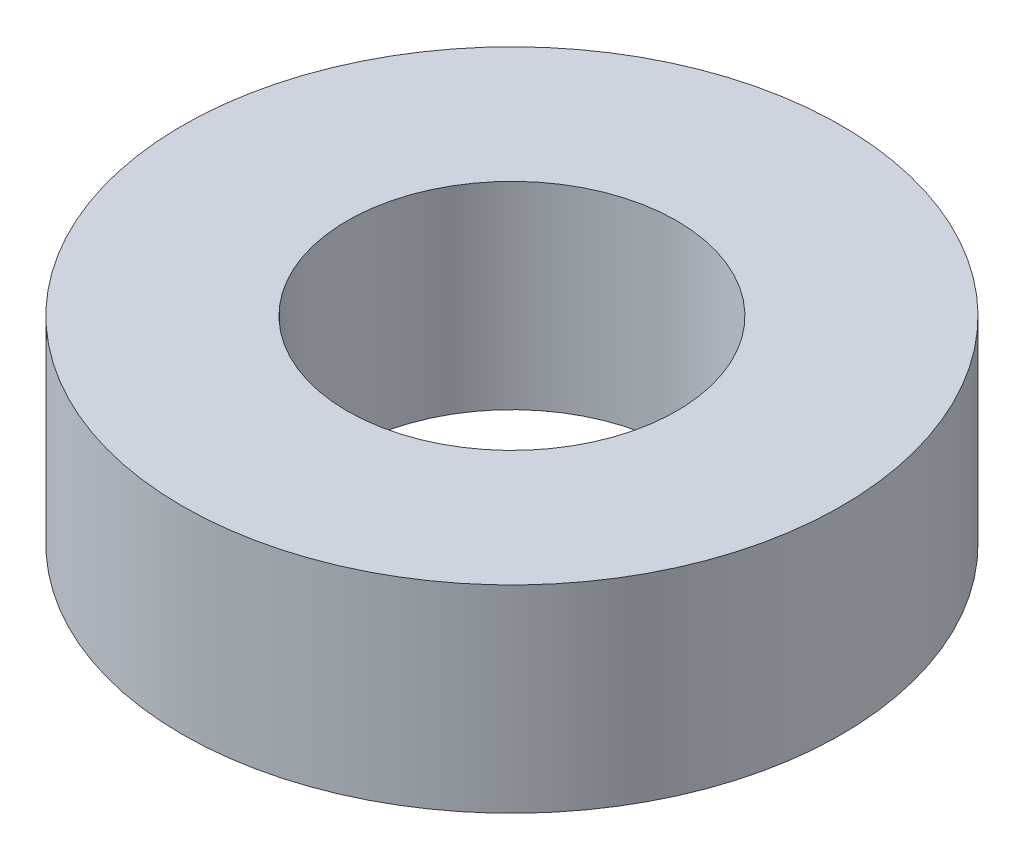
ISO-10303-21;
HEADER;
FILE_DESCRIPTION(('STEP AP214'),'2;1');
FILE_NAME('part.step','',(''),(''),'','','');
FILE_SCHEMA(('AUTOMOTIVE_DESIGN { 1 0 10303 214 1 1 1 1 }'));
ENDSEC;
DATA;
#1=APPLICATION_CONTEXT('core data for automotive mechanical design processes');
#2=APPLICATION_PROTOCOL_DEFINITION('international standard','automotive_design',2000,#1);
#3=PRODUCT_CONTEXT('',#1,'mechanical');
#4=PRODUCT('Part','Part','',(#3));
#5=PRODUCT_RELATED_PRODUCT_CATEGORY('part','',(#4));
#6=PRODUCT_DEFINITION_FORMATION('','',#4);
#7=PRODUCT_DEFINITION_CONTEXT('part definition',#1,'design');
#8=PRODUCT_DEFINITION('design','',#6,#7);
#9=PRODUCT_DEFINITION_SHAPE('','',#8);
#10=(LENGTH_UNIT() NAMED_UNIT(*) SI_UNIT(.MILLI.,.METRE.));
#11=(NAMED_UNIT(*) PLANE_ANGLE_UNIT() SI_UNIT($,.RADIAN.));
#12=(NAMED_UNIT(*) SI_UNIT($,.STERADIAN.) SOLID_ANGLE_UNIT());
#13=UNCERTAINTY_MEASURE_WITH_UNIT(LENGTH_MEASURE(1.E-05),#10,'distance_accuracy_value','');
#14=(GEOMETRIC_REPRESENTATION_CONTEXT(3) GLOBAL_UNCERTAINTY_ASSIGNED_CONTEXT((#13)) GLOBAL_UNIT_ASSIGNED_CONTEXT((#10,
#11,#12)) REPRESENTATION_CONTEXT('',''));
#15=CARTESIAN_POINT('',(0.,0.,0.));
#16=DIRECTION('',(0.,0.,1.));
#17=DIRECTION('',(1.,0.,0.));
#18=AXIS2_PLACEMENT_3D('',#15,#16,#17);
#19=CARTESIAN_POINT('',(0.,30.,0.));
#20=DIRECTION('',(0.,1.,0.));
#21=DIRECTION('',(0.,0.,1.));
#22=AXIS2_PLACEMENT_3D('',#19,#20,#21);
#23=PLANE('',#22);
#24=CARTESIAN_POINT('',(0.,30.,0.));
#25=DIRECTION('',(0.,1.,0.));
#26=DIRECTION('',(0.,0.,1.));
#27=AXIS2_PLACEMENT_3D('',#24,#25,#26);
#28=CIRCLE('',#27,50.);
#29=CARTESIAN_POINT('',(0.,30.,50.));
#30=VERTEX_POINT('',#29);
#31=EDGE_CURVE('E10',#30,#30,#28,.T.);
#32=ORIENTED_EDGE('',*,*,#31,.T.);
#33=EDGE_LOOP('',(#32));
#34=FACE_BOUND('',#33,.T.);
#35=CARTESIAN_POINT('',(0.,30.,0.));
#36=DIRECTION('',(0.,1.,0.));
#37=DIRECTION('',(0.,0.,1.));
#38=AXIS2_PLACEMENT_3D('',#35,#36,#37);
#39=CIRCLE('',#38,25.);
#40=CARTESIAN_POINT('',(0.,30.,25.));
#41=VERTEX_POINT('',#40);
#42=EDGE_CURVE('E50',#41,#41,#39,.T.);
#43=ORIENTED_EDGE('',*,*,#42,.F.);
#44=EDGE_LOOP('',(#43));
#45=FACE_BOUND('',#44,.T.);
#46=ADVANCED_FACE('F37',(#34,#45),#23,.T.);
#47=CARTESIAN_POINT('',(0.,0.,0.));
#48=DIRECTION('',(0.,1.,0.));
#49=DIRECTION('',(0.,0.,1.));
#50=AXIS2_PLACEMENT_3D('',#47,#48,#49);
#51=PLANE('',#50);
#52=CARTESIAN_POINT('',(0.,0.,0.));
#53=DIRECTION('',(0.,1.,0.));
#54=DIRECTION('',(0.,0.,1.));
#55=AXIS2_PLACEMENT_3D('',#52,#53,#54);
#56=CIRCLE('',#55,50.);
#57=CARTESIAN_POINT('',(0.,0.,50.));
#58=VERTEX_POINT('',#57);
#59=EDGE_CURVE('E41',#58,#58,#56,.T.);
#60=ORIENTED_EDGE('',*,*,#59,.F.);
#61=EDGE_LOOP('',(#60));
#62=FACE_BOUND('',#61,.T.);
#63=CARTESIAN_POINT('',(0.,0.,0.));
#64=DIRECTION('',(0.,1.,0.));
#65=DIRECTION('',(0.,0.,1.));
#66=AXIS2_PLACEMENT_3D('',#63,#64,#65);
#67=CIRCLE('',#66,25.);
#68=CARTESIAN_POINT('',(0.,0.,25.));
#69=VERTEX_POINT('',#68);
#70=EDGE_CURVE('E52',#69,#69,#67,.T.);
#71=ORIENTED_EDGE('',*,*,#70,.T.);
#72=EDGE_LOOP('',(#71));
#73=FACE_BOUND('',#72,.T.);
#74=ADVANCED_FACE('F64',(#62,#73),#51,.F.);
#75=CARTESIAN_POINT('',(0.,30.,0.));
#76=DIRECTION('',(0.,-1.,0.));
#77=DIRECTION('',(0.,0.,-1.));
#78=AXIS2_PLACEMENT_3D('',#75,#76,#77);
#79=CYLINDRICAL_SURFACE('',#78,50.);
#80=ORIENTED_EDGE('',*,*,#31,.F.);
#81=EDGE_LOOP('',(#80));
#82=FACE_BOUND('',#81,.T.);
#83=ORIENTED_EDGE('',*,*,#59,.T.);
#84=EDGE_LOOP('',(#83));
#85=FACE_BOUND('',#84,.T.);
#86=ADVANCED_FACE('F39',(#82,#85),#79,.T.);
#87=CARTESIAN_POINT('',(0.,30.,0.));
#88=DIRECTION('',(0.,-1.,0.));
#89=DIRECTION('',(0.,0.,-1.));
#90=AXIS2_PLACEMENT_3D('',#87,#88,#89);
#91=CYLINDRICAL_SURFACE('',#90,25.);
#92=ORIENTED_EDGE('',*,*,#42,.T.);
#93=EDGE_LOOP('',(#92));
#94=FACE_BOUND('',#93,.T.);
#95=ORIENTED_EDGE('',*,*,#70,.F.);
#96=EDGE_LOOP('',(#95));
#97=FACE_BOUND('',#96,.T.);
#98=ADVANCED_FACE('F60',(#94,#97),#91,.F.);
#99=CLOSED_SHELL('',(#46,#74,#86,#98));
#100=MANIFOLD_SOLID_BREP('B2',#99);
#101=ADVANCED_BREP_SHAPE_REPRESENTATION('',(#18,#100),#14);
#102=SHAPE_DEFINITION_REPRESENTATION(#9,#101);
ENDSEC;
END-ISO-10303-21;
